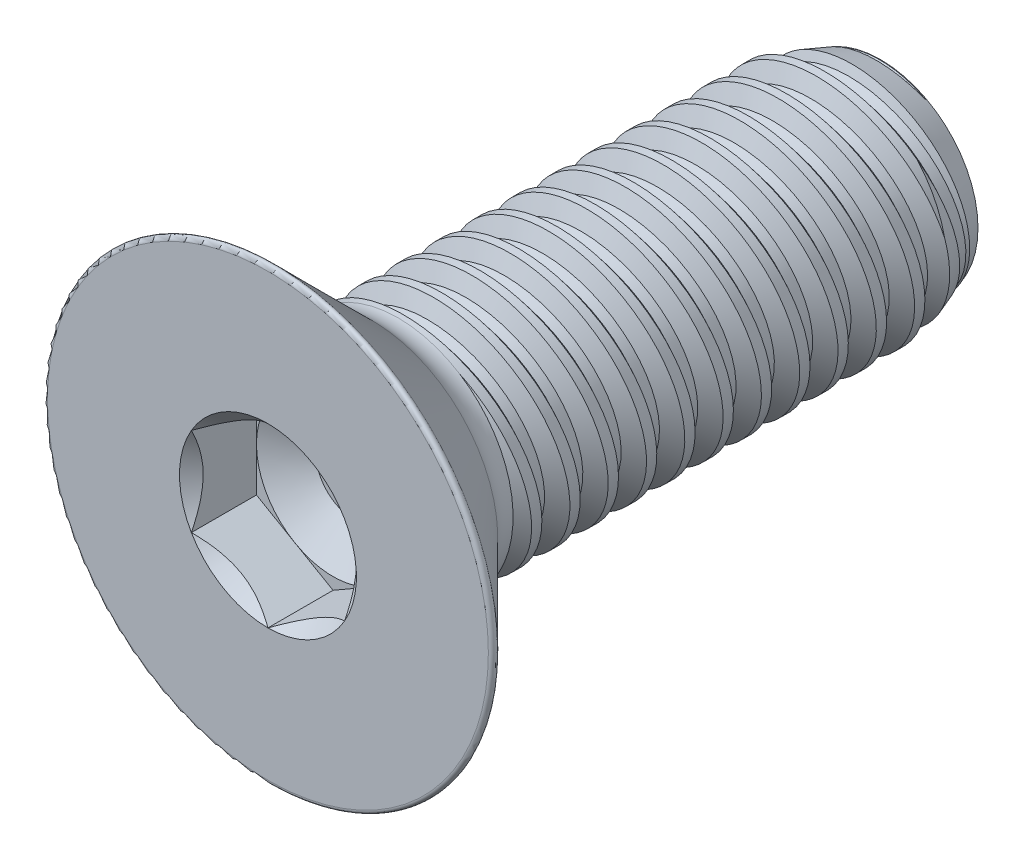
from build123d import *

# Parameters (mm, degrees)
SKETCH1_W          = 6.3
SKETCH1_H          = 1.5
LPATTERN1_COUNT    = 13
LPATTERN1_PITCH    = 0.5
LPATTERN2_COUNT    = 2
LPATTERN2_PITCH    = 0.5
SKETCH4_R          = 3
EXTRUDE1_DEPTH     = 1.7
FILLET1_R          = 0.0508
CUT_EXTRUDE1_DEPTH = 0.85
SKETCH7_R          = 1.154700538
CUT_EXTRUDE4_DEPTH = 0.85
CUT_EXTRUDE4_DRAFT = -45
SKETCH8_R          = 1
CUT_EXTRUDE5_DEPTH = 0.283333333
CUT_EXTRUDE5_DRAFT = -60


with BuildPart() as part:
    # Sketch1 → Revolve1 (revolve)
    with BuildSketch(Plane(origin=(0, 0, 0), x_dir=(0, 0, -1), z_dir=(1, 0, 0)), mode=Mode.PRIVATE) as revolve1_sk:
        with Locations((3.15, 0.75)):
            Rectangle(SKETCH1_W, SKETCH1_H)
    revolve(revolve1_sk.sketch.rotate(Axis((0, 0, 0), (0, 0, 1)), 143.496238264), axis=Axis((0, 0, 0), (0, 0, 1)))

    # Sketch2 → Cut-Revolve1 (revolve, cut)
    with BuildSketch(Plane(origin=(0, 0, 0), x_dir=(0, 0, -1), z_dir=(1, 0, 0)), mode=Mode.PRIVATE) as cut_revolve1_sk:
        Polygon((0.06164962, 1.510274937), (0.493196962, 1.582199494), (0.383564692, 1.289561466), (0.260265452, 1.269011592), align=None)
    cut_revolve1 = revolve(cut_revolve1_sk.sketch.rotate(Axis((0, -0.089188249, 0), (0, 0.16439898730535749, -0.9863939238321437)), 180), axis=Axis((0, -0.089188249, 0), (0, 0.16439898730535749, -0.9863939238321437)), mode=Mode.SUBTRACT)

    # Sketch3 → Cut-Revolve2 (revolve, cut)
    with BuildSketch(Plane(origin=(0, 0, 0), x_dir=(0, 0, -1), z_dir=(1, 0, 0)), mode=Mode.PRIVATE) as cut_revolve2_sk:
        Polygon((6.3, 1.269011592), (5.665364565, 1.5), (6.3, 1.5), align=None)
    revolve(cut_revolve2_sk.sketch.rotate(Axis((0, 0, -5.665364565), (0, 0, 1)), 143.496238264), axis=Axis((0, 0, -5.665364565), (0, 0, 1)), mode=Mode.SUBTRACT)

    # LPattern1: Cut-Revolve1 ×13
    with Locations(*[(0, 0, -i * LPATTERN1_PITCH) for i in range(1, LPATTERN1_COUNT)]):
        add(cut_revolve1, mode=Mode.SUBTRACT)

    # LPattern2: Cut-Revolve1 ×2
    with Locations(*[(0, 0, i * LPATTERN2_PITCH) for i in range(1, LPATTERN2_COUNT)]):
        add(cut_revolve1, mode=Mode.SUBTRACT)

    # Sketch4 → Extrude1 (add)
    with BuildSketch(Plane.XY):
        Circle(SKETCH4_R)
    extrude(amount=EXTRUDE1_DEPTH)

    # Sketch9 → Cut-Revolve3 (revolve, cut)
    with BuildSketch(Plane(origin=(0, 0, 0), x_dir=(0, 0, -1), z_dir=(1, 0, 0)), mode=Mode.PRIVATE) as cut_revolve3_sk:
        Polygon((-1.7, 3), (0, 1.3), (0, 3), align=None)
    revolve(cut_revolve3_sk.sketch.rotate(Axis((0, 0, 0), (0, 0, 1)), 180), axis=Axis((0, 0, 0), (0, 0, 1)), mode=Mode.SUBTRACT)

    # Fillet1
    fillet1_edges = [part.edges().sort_by_distance(p)[0] for p in [
        (0, 3, 1.7),
    ]]
    fillet(fillet1_edges, radius=FILLET1_R)

    # Sketch6 → Cut-Extrude1 (cut)
    with BuildSketch(Plane.XY.offset(1.7)):
        Polygon((0, -1.154700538), (1, -0.577350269), (1, 0.577350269), (0, 1.154700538), (-1, 0.577350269), (-1, -0.577350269), align=None)
    extrude(amount=-CUT_EXTRUDE1_DEPTH, mode=Mode.SUBTRACT)


with BuildPart() as cut_extrude4_tool:
    # Sketch7 → Cut-Extrude4 (with draft: the straight prism first)
    with BuildSketch(Plane.XY.offset(1.7)):
        Circle(SKETCH7_R)
    extrude(amount=-CUT_EXTRUDE4_DEPTH)
    # Cut-Extrude4: the draft: its side faces are tilted about the plane it starts from
    cut_extrude4_sides = [cut_extrude4_tool.faces().sort_by_distance(p)[0] for p in [
        (-1.154700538, 0, 1.275),
    ]]
    draft(cut_extrude4_sides, Plane.XY.offset(1.7), CUT_EXTRUDE4_DRAFT)


with BuildPart() as part_1:
    add(part.part)

    # Cut-Extrude4: cut by cut_extrude4_tool
    add(cut_extrude4_tool.part, mode=Mode.SUBTRACT)


with BuildPart() as cut_extrude5_tool:
    # Sketch8 → Cut-Extrude5 (with draft: the straight prism first)
    with BuildSketch(Plane.XY.offset(0.85)):
        Circle(SKETCH8_R)
    extrude(amount=-CUT_EXTRUDE5_DEPTH)
    # Cut-Extrude5: the draft: its side faces are tilted about the plane it starts from
    cut_extrude5_sides = [cut_extrude5_tool.faces().sort_by_distance(p)[0] for p in [
        (-1, 0, 0.708333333),
    ]]
    draft(cut_extrude5_sides, Plane.XY.offset(0.85), CUT_EXTRUDE5_DRAFT)


with BuildPart() as part_2:
    add(part_1.part)

    # Cut-Extrude5: cut by cut_extrude5_tool
    add(cut_extrude5_tool.part, mode=Mode.SUBTRACT)

    # Sketch12 → Revolve2 (revolve)
    with BuildSketch(Plane(origin=(0, 0, 0), x_dir=(0, 0, -1), z_dir=(1, 0, 0)), mode=Mode.PRIVATE) as revolve2_sk:
        with BuildLine():
            Line((0, 1.5), (0, 1.3))
            Line((0, 1.3), (-0.341421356, 1.641421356))
            ThreePointArc((-0.341421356, 1.641421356), (-0.184775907, 1.536754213), (0, 1.5))
        make_face()
    revolve(revolve2_sk.sketch.rotate(Axis((0, 0, 0), (0, 0, 1)), 152.502934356), axis=Axis((0, 0, 0), (0, 0, 1)))


solid = part_2.part
